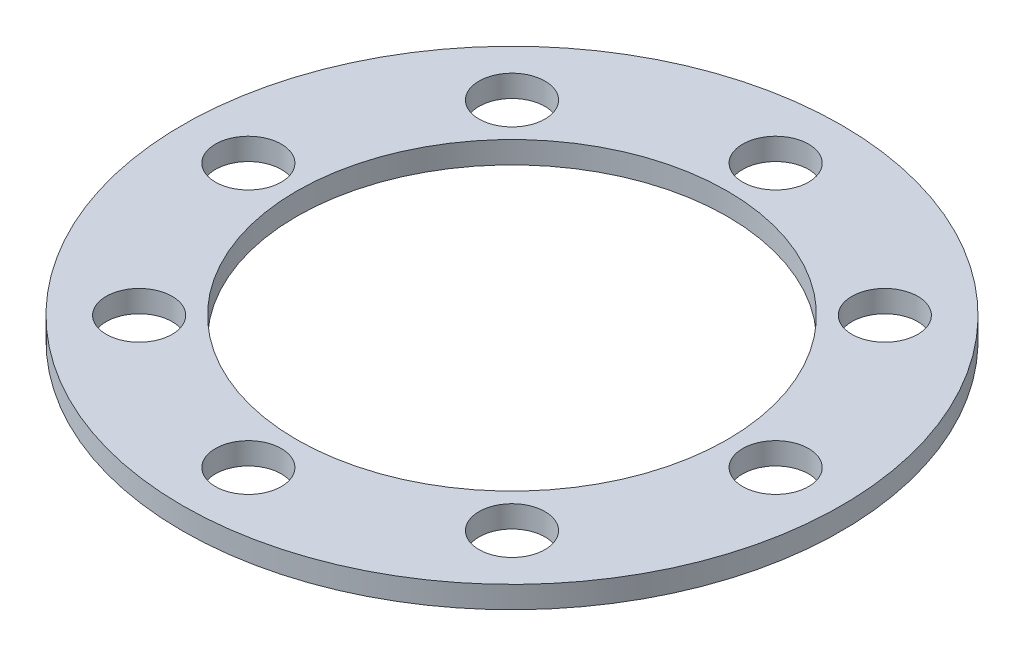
from build123d import *

# Parameters (mm, degrees)
SKETCH1_R           = 47.625
SKETCH1_R_2         = 31.115
SKETCH1_R_3         = 4.7625
BOSS_EXTRUDE1_DEPTH = 3.175


with BuildPart() as part:
    # Sketch1 → Boss-Extrude1 (new body)
    with BuildSketch(Plane(origin=(0, 0, 0), x_dir=(1, 0, 0), z_dir=(0, 1, 0))):
        with Locations(Location((0, 0, 0), (0, 0, 270))):
            Circle(SKETCH1_R)
        with Locations(Location((0, 0, 0), (0, 0, 270))):
            Circle(SKETCH1_R_2, mode=Mode.SUBTRACT)
        with Locations(Location((0, 38.1, 0), (0, 0, 270))):
            Circle(SKETCH1_R_3, mode=Mode.SUBTRACT)
        with Locations(Location((26.940768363, 26.940768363, 0), (0, 0, 270))):
            Circle(SKETCH1_R_3, mode=Mode.SUBTRACT)
        with Locations(Location((38.1, 0, 0), (0, 0, 270))):
            Circle(SKETCH1_R_3, mode=Mode.SUBTRACT)
        with Locations(Location((26.940768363, -26.940768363, 0), (0, 0, 270))):
            Circle(SKETCH1_R_3, mode=Mode.SUBTRACT)
        with Locations(Location((0, -38.1, 0), (0, 0, 270))):
            Circle(SKETCH1_R_3, mode=Mode.SUBTRACT)
        with Locations(Location((-26.940768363, -26.940768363, 0), (0, 0, 270))):
            Circle(SKETCH1_R_3, mode=Mode.SUBTRACT)
        with Locations(Location((-38.1, 0, 0), (0, 0, 270))):
            Circle(SKETCH1_R_3, mode=Mode.SUBTRACT)
        with Locations(Location((-26.940768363, 26.940768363, 0), (0, 0, 270))):
            Circle(SKETCH1_R_3, mode=Mode.SUBTRACT)
    extrude(amount=BOSS_EXTRUDE1_DEPTH)


solid = part.part
